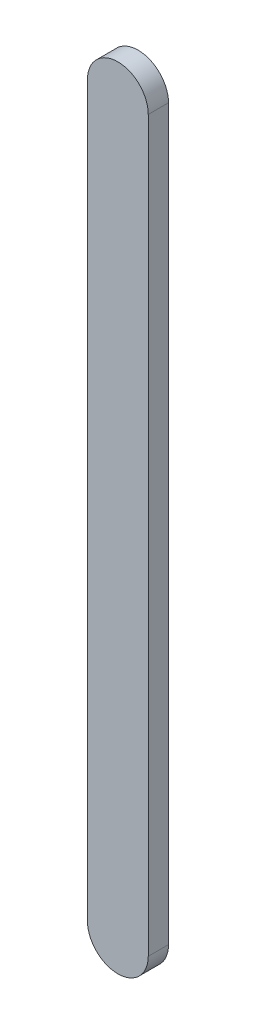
from build123d import *

# Parameters (mm, degrees)
BOSS_EXTRUDE1_DEPTH = 3.175


with BuildPart() as part:
    # Sketch1 → Boss-Extrude1 (new body)
    with BuildSketch(Plane.XY):
        with BuildLine():
            Line((4.7625, 0), (4.7625, -114.3))
            ThreePointArc((4.7625, -114.3), (0, -119.0625), (-4.7625, -114.3))
            Line((-4.7625, -114.3), (-4.7625, 0))
            ThreePointArc((-4.7625, 0), (0, 4.7625), (4.7625, 0))
        make_face()
    extrude(amount=BOSS_EXTRUDE1_DEPTH)


solid = part.part
